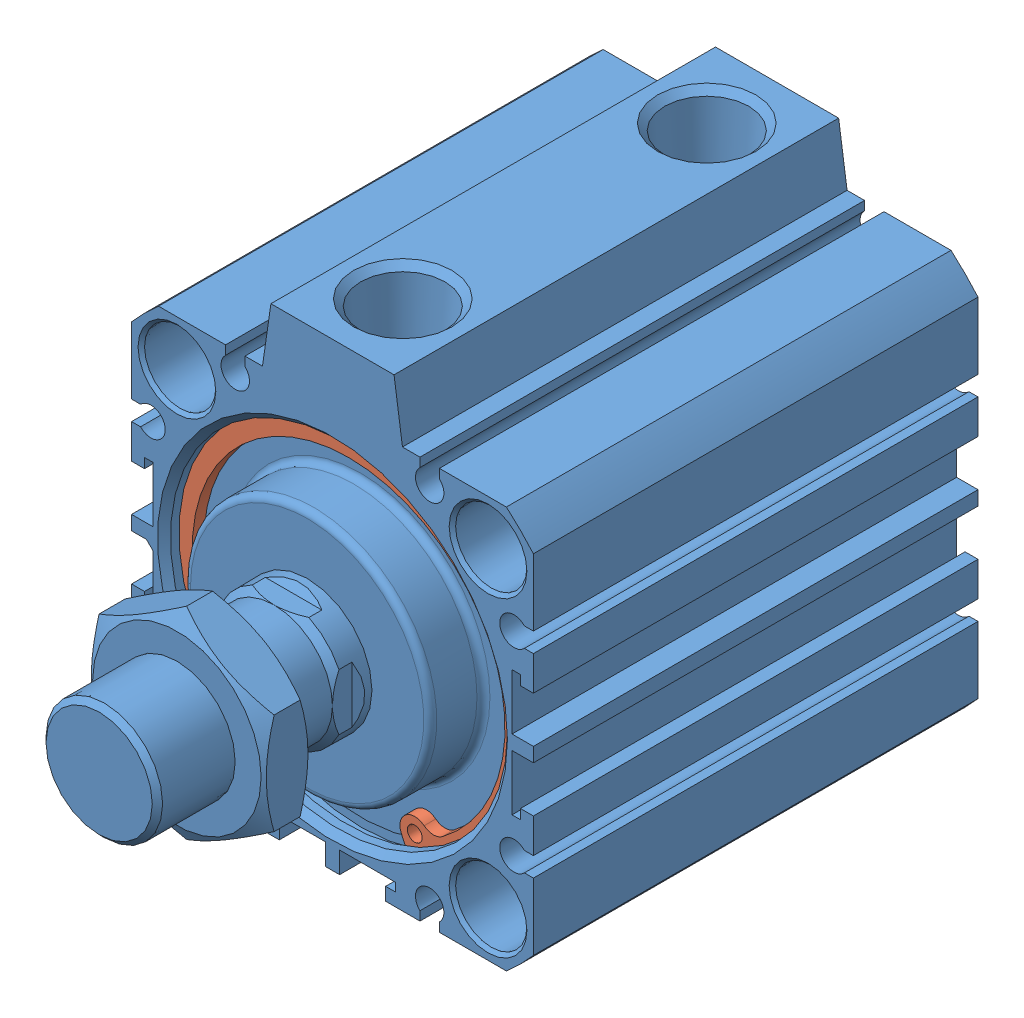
SolidWorks assembly JD50x30-BS.sldasm, configuration 默认 (file format 4400). Lengths in mm.
Overall size (62 71 104.6).
3 component instances, 2 part files, 0 mates.
Components (placement in the parent):
- JD50x30-BS-1: JD50x30-BS.sldprt [默认] at origin size (62 71 104.6)
- R _X2_5F6274B0_X0_ 52-1: R _X2_5F6274B0_X0_ 52.sldprt [默认] at (-0.1196 25.8373 64.1) size (55.3 53.65 2)
- R _X2_5F6274B0_X0_ 52-2: R _X2_5F6274B0_X0_ 52.sldprt [默认] at (-0.1196 25.8373 2.5) size (55.3 53.65 2)
